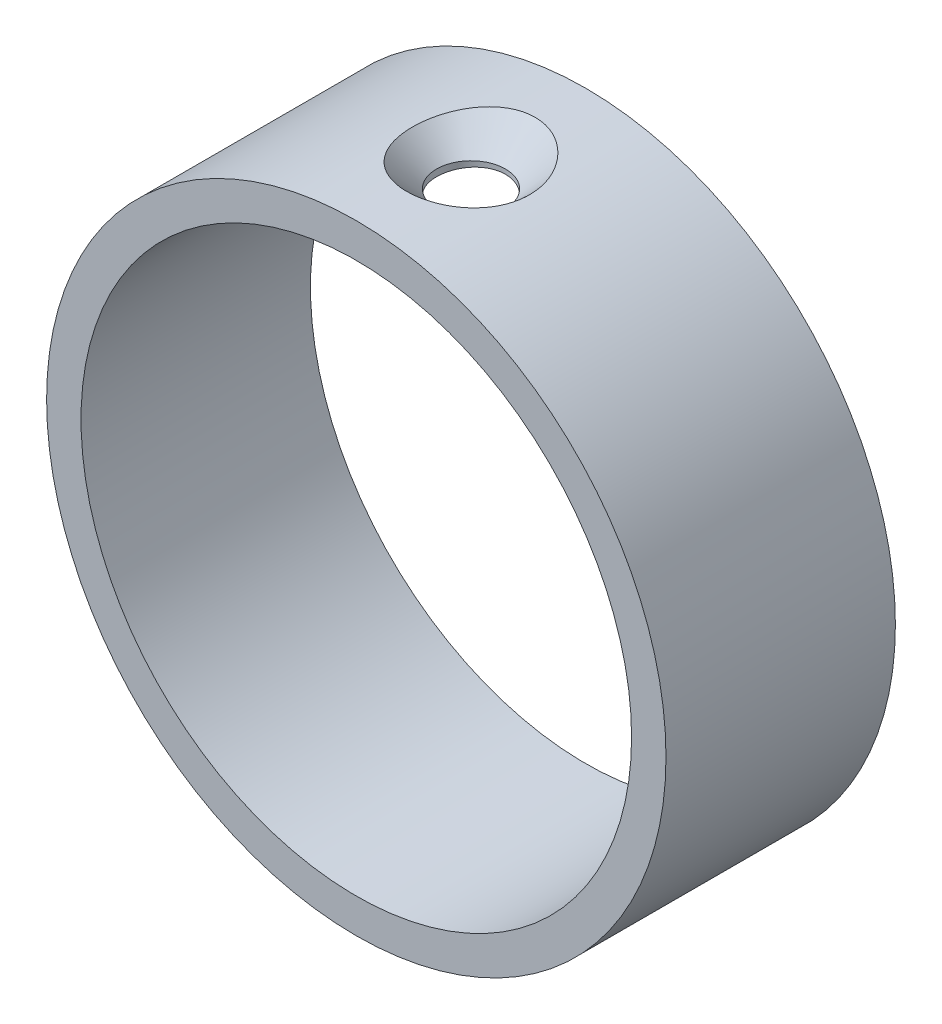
from build123d import *

# Parameters (mm, degrees)
SKETCH1_R      = 13.5
SKETCH1_R_2    = 12
EXTRUDE1_DEPTH = 5


with BuildPart() as part:
    # Sketch1 → Extrude1 (new, symmetric)
    with BuildSketch(Plane.XY):
        Circle(SKETCH1_R)
        Circle(SKETCH1_R_2, mode=Mode.SUBTRACT)
    extrude(amount=EXTRUDE1_DEPTH, both=True)

    # Sketch2 → Cut-Revolve1 (revolve, cut)
    with BuildSketch(Plane.XY, mode=Mode.PRIVATE) as cut_revolve1_sk:
        Polygon((0, 0), (1.5, 0), (1.5, 12.2), (6.007670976, 16.707670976), (0, 16.707670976), align=None)
    revolve(cut_revolve1_sk.sketch.rotate(Axis((0, 0, 0), (0, 1, 0)), 129.118617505), axis=Axis((0, 0, 0), (0, 1, 0)), mode=Mode.SUBTRACT)


solid = part.part
